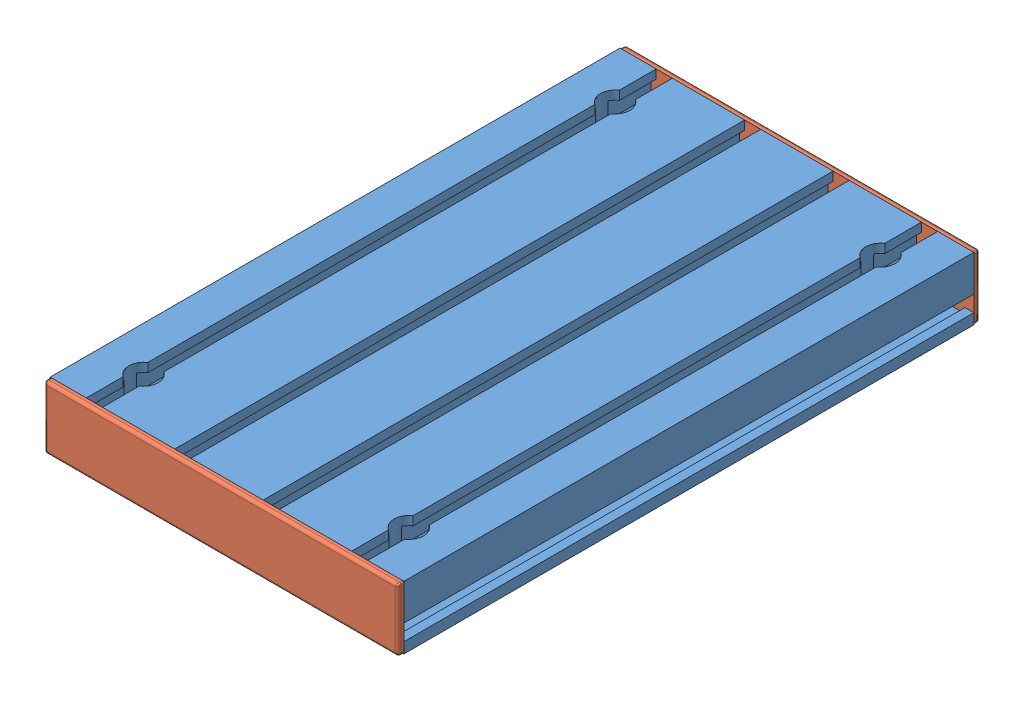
SolidWorks assembly 21.1735 FLOOR MOUNTING PLATE 180.SLDASM, configuration Default (file format 3800). Lengths in mm.
Overall size (180.01 32.01 296.01).
3 component instances, 2 part files, 6 mates.
Components (placement in the parent):
- 21.1735 FLOOR MOUNTING PLATE 180-1: 21.1735 FLOOR MOUNTING PLATE 180.SLDPRT [Default] at origin size (180 32 290)
- 22.1059_1 END CAP 32X180 GRAY-1: 22.1059_1 END CAP 32X180 GRAY.SLDPRT [Default] at (0 13 148) x (0 -1 0) z (0 0 -1) size (32.01 180.01 3)
- 22.1059_1 END CAP 32X180 GRAY-2: 22.1059_1 END CAP 32X180 GRAY.SLDPRT [Default] at (0 0 -148) x (0 1 0) z (0 0 1) size (32.01 180.01 3)
Mates (geometry in assembly coordinates):
- Coincident1: coincident: plane of 22.1059_1 END CAP 32X180 GRAY-1 through (0 6.5 145) normal (0 0 -1); plane of 21.1735 FLOOR MOUNTING PLATE 180-1 through (-74.3 18 145) normal (0 0 1)
- Coincident2: coincident: plane of 21.1735 FLOOR MOUNTING PLATE 180-1 through (18.4 22.5 -145) normal (0 1 0); plane of 22.1059_1 END CAP 32X180 GRAY-1 through (90 22.5 148) normal (0 1 0)
- Coincident3: coincident aligned: plane of 21.1735 FLOOR MOUNTING PLATE 180-1 through (90 4.1 -145) normal (1 0 0); plane of 22.1059_1 END CAP 32X180 GRAY-1 through (90 -9.5 148) normal (1 0 0)
- Coincident4: coincident: plane of 21.1735 FLOOR MOUNTING PLATE 180-1 through (-74.3 18 -145) normal (0 0 -1); plane of ? through (97.3235 6.5 -145) normal (0 0 1)
- Coincident5: coincident: plane of ? through (7.3235 22.5 -148) normal (0 1 0); plane of 21.1735 FLOOR MOUNTING PLATE 180-1 through (63.4 22.5 -145) normal (0 1 0)
- Coincident6: coincident aligned: plane of 21.1735 FLOOR MOUNTING PLATE 180-1 through (-90 22.5 -145) normal (-1 0 0); plane of ? through (7.3235 -9.5 -148) normal (-1 0 0)
